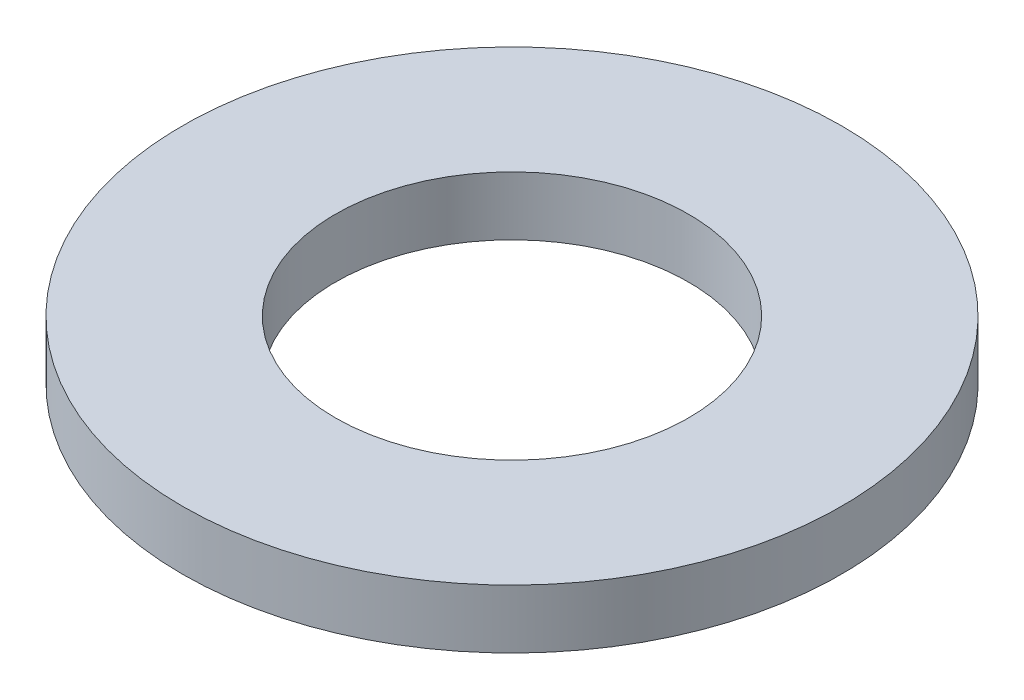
from build123d import *

# Parameters (mm, degrees)
SKETCH1_R      = 14
SKETCH1_R_2    = 7.5
EXTRUDE1_DEPTH = 2.5


with BuildPart() as part:
    # Sketch1 → Extrude1 (new body)
    with BuildSketch(Plane(origin=(0, 0, 0), x_dir=(1, 0, 0), z_dir=(0, 1, 0))):
        with Locations(Location((0, 0, 0), (0, 0, 270))):
            Circle(SKETCH1_R)
        with Locations(Location((0, 0, 0), (0, 0, 270))):
            Circle(SKETCH1_R_2, mode=Mode.SUBTRACT)
    extrude(amount=EXTRUDE1_DEPTH)


solid = part.part
